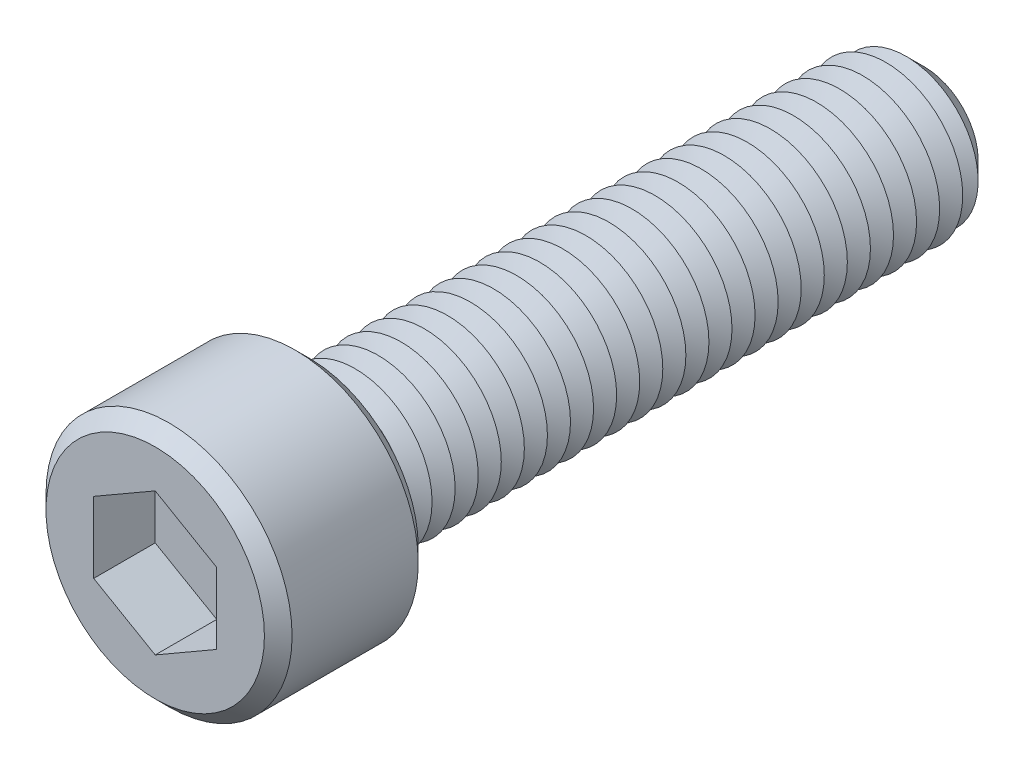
ISO-10303-21;
HEADER;
FILE_DESCRIPTION(('STEP AP214'),'2;1');
FILE_NAME('part.step','',(''),(''),'','','');
FILE_SCHEMA(('AUTOMOTIVE_DESIGN { 1 0 10303 214 1 1 1 1 }'));
ENDSEC;
DATA;
#1=APPLICATION_CONTEXT('core data for automotive mechanical design processes');
#2=APPLICATION_PROTOCOL_DEFINITION('international standard','automotive_design',2000,#1);
#3=PRODUCT_CONTEXT('',#1,'mechanical');
#4=PRODUCT('Part','Part','',(#3));
#5=PRODUCT_RELATED_PRODUCT_CATEGORY('part','',(#4));
#6=PRODUCT_DEFINITION_FORMATION('','',#4);
#7=PRODUCT_DEFINITION_CONTEXT('part definition',#1,'design');
#8=PRODUCT_DEFINITION('design','',#6,#7);
#9=PRODUCT_DEFINITION_SHAPE('','',#8);
#10=(LENGTH_UNIT() NAMED_UNIT(*) SI_UNIT(.MILLI.,.METRE.));
#11=(NAMED_UNIT(*) PLANE_ANGLE_UNIT() SI_UNIT($,.RADIAN.));
#12=(NAMED_UNIT(*) SI_UNIT($,.STERADIAN.) SOLID_ANGLE_UNIT());
#13=UNCERTAINTY_MEASURE_WITH_UNIT(LENGTH_MEASURE(1.E-05),#10,'distance_accuracy_value','');
#14=(GEOMETRIC_REPRESENTATION_CONTEXT(3) GLOBAL_UNCERTAINTY_ASSIGNED_CONTEXT((#13)) GLOBAL_UNIT_ASSIGNED_CONTEXT((#10,
#11,#12)) REPRESENTATION_CONTEXT('',''));
#15=CARTESIAN_POINT('',(0.,0.,0.));
#16=DIRECTION('',(0.,0.,1.));
#17=DIRECTION('',(1.,0.,0.));
#18=AXIS2_PLACEMENT_3D('',#15,#16,#17);
#19=CARTESIAN_POINT('',(0.,0.,10.));
#20=DIRECTION('',(0.,0.,-1.));
#21=DIRECTION('',(-1.,0.,0.));
#22=AXIS2_PLACEMENT_3D('',#19,#20,#21);
#23=CYLINDRICAL_SURFACE('',#22,8.);
#24=CARTESIAN_POINT('',(0.,0.,0.899999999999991));
#25=DIRECTION('',(0.,0.,1.));
#26=DIRECTION('',(1.,0.,0.));
#27=AXIS2_PLACEMENT_3D('',#24,#25,#26);
#28=CIRCLE('',#27,8.);
#29=CARTESIAN_POINT('',(8.,0.,0.899999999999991));
#30=VERTEX_POINT('',#29);
#31=EDGE_CURVE('E384',#30,#30,#28,.T.);
#32=ORIENTED_EDGE('',*,*,#31,.T.);
#33=EDGE_LOOP('',(#32));
#34=FACE_BOUND('',#33,.T.);
#35=CARTESIAN_POINT('',(0.,0.,9.1));
#36=DIRECTION('',(0.,0.,1.));
#37=DIRECTION('',(1.,0.,0.));
#38=AXIS2_PLACEMENT_3D('',#35,#36,#37);
#39=CIRCLE('',#38,8.);
#40=CARTESIAN_POINT('',(8.,0.,9.1));
#41=VERTEX_POINT('',#40);
#42=EDGE_CURVE('E377',#41,#41,#39,.F.);
#43=ORIENTED_EDGE('',*,*,#42,.T.);
#44=EDGE_LOOP('',(#43));
#45=FACE_BOUND('',#44,.T.);
#46=ADVANCED_FACE('F39',(#34,#45),#23,.T.);
#47=CARTESIAN_POINT('',(0.,0.,10.));
#48=DIRECTION('',(0.,0.,1.));
#49=DIRECTION('',(1.,0.,0.));
#50=AXIS2_PLACEMENT_3D('',#47,#48,#49);
#51=PLANE('',#50);
#52=CARTESIAN_POINT('',(0.,0.,10.));
#53=DIRECTION('',(0.,0.,1.));
#54=DIRECTION('',(1.,0.,0.));
#55=AXIS2_PLACEMENT_3D('',#52,#53,#54);
#56=CIRCLE('',#55,7.1);
#57=CARTESIAN_POINT('',(7.1,0.,10.));
#58=VERTEX_POINT('',#57);
#59=EDGE_CURVE('E11',#58,#58,#56,.T.);
#60=ORIENTED_EDGE('',*,*,#59,.T.);
#61=EDGE_LOOP('',(#60));
#62=FACE_BOUND('',#61,.T.);
#63=DIRECTION('',(-0.866025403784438,0.5,0.));
#64=VECTOR('',#63,1.);
#65=CARTESIAN_POINT('',(4.,2.3094010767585,10.));
#66=LINE('',#65,#64);
#67=CARTESIAN_POINT('',(4.,2.3094010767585,10.));
#68=VERTEX_POINT('',#67);
#69=CARTESIAN_POINT('',(0.,4.61880215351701,10.));
#70=VERTEX_POINT('',#69);
#71=EDGE_CURVE('E55',#68,#70,#66,.T.);
#72=ORIENTED_EDGE('',*,*,#71,.F.);
#73=DIRECTION('',(0.,1.,0.));
#74=VECTOR('',#73,1.);
#75=CARTESIAN_POINT('',(4.,-2.30940107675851,10.));
#76=LINE('',#75,#74);
#77=CARTESIAN_POINT('',(4.,-2.30940107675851,10.));
#78=VERTEX_POINT('',#77);
#79=EDGE_CURVE('E151',#78,#68,#76,.T.);
#80=ORIENTED_EDGE('',*,*,#79,.F.);
#81=DIRECTION('',(0.866025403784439,0.5,0.));
#82=VECTOR('',#81,1.);
#83=CARTESIAN_POINT('',(0.,-4.61880215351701,10.));
#84=LINE('',#83,#82);
#85=CARTESIAN_POINT('',(0.,-4.61880215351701,10.));
#86=VERTEX_POINT('',#85);
#87=EDGE_CURVE('E148',#86,#78,#84,.T.);
#88=ORIENTED_EDGE('',*,*,#87,.F.);
#89=DIRECTION('',(0.866025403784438,-0.5,0.));
#90=VECTOR('',#89,1.);
#91=CARTESIAN_POINT('',(-4.,-2.3094010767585,10.));
#92=LINE('',#91,#90);
#93=CARTESIAN_POINT('',(-4.,-2.3094010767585,10.));
#94=VERTEX_POINT('',#93);
#95=EDGE_CURVE('E103',#94,#86,#92,.T.);
#96=ORIENTED_EDGE('',*,*,#95,.F.);
#97=DIRECTION('',(0.,-1.,0.));
#98=VECTOR('',#97,1.);
#99=CARTESIAN_POINT('',(-4.,2.3094010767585,10.));
#100=LINE('',#99,#98);
#101=CARTESIAN_POINT('',(-4.,2.3094010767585,10.));
#102=VERTEX_POINT('',#101);
#103=EDGE_CURVE('E142',#102,#94,#100,.T.);
#104=ORIENTED_EDGE('',*,*,#103,.F.);
#105=DIRECTION('',(-0.866025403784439,-0.5,0.));
#106=VECTOR('',#105,1.);
#107=CARTESIAN_POINT('',(0.,4.61880215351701,10.));
#108=LINE('',#107,#106);
#109=EDGE_CURVE('E137',#70,#102,#108,.T.);
#110=ORIENTED_EDGE('',*,*,#109,.F.);
#111=EDGE_LOOP('',(#72,#80,#88,#96,#104,#110));
#112=FACE_BOUND('',#111,.T.);
#113=ADVANCED_FACE('F402',(#62,#112),#51,.T.);
#114=CARTESIAN_POINT('',(0.,0.,0.));
#115=DIRECTION('',(0.,0.,1.));
#116=DIRECTION('',(1.,0.,0.));
#117=AXIS2_PLACEMENT_3D('',#114,#115,#116);
#118=PLANE('',#117);
#119=CARTESIAN_POINT('',(0.,0.,0.));
#120=DIRECTION('',(0.,0.,1.));
#121=DIRECTION('',(1.,0.,0.));
#122=AXIS2_PLACEMENT_3D('',#119,#120,#121);
#123=CIRCLE('',#122,7.1);
#124=CARTESIAN_POINT('',(7.1,0.,0.));
#125=VERTEX_POINT('',#124);
#126=EDGE_CURVE('E48',#125,#125,#123,.F.);
#127=ORIENTED_EDGE('',*,*,#126,.T.);
#128=EDGE_LOOP('',(#127));
#129=FACE_BOUND('',#128,.T.);
#130=CARTESIAN_POINT('',(0.,0.,0.));
#131=DIRECTION('',(0.,0.,1.));
#132=DIRECTION('',(1.,0.,0.));
#133=AXIS2_PLACEMENT_3D('',#130,#131,#132);
#134=CIRCLE('',#133,5.);
#135=CARTESIAN_POINT('',(5.,0.,0.));
#136=VERTEX_POINT('',#135);
#137=EDGE_CURVE('E369',#136,#136,#134,.T.);
#138=ORIENTED_EDGE('',*,*,#137,.T.);
#139=EDGE_LOOP('',(#138));
#140=FACE_BOUND('',#139,.T.);
#141=ADVANCED_FACE('F391',(#129,#140),#118,.F.);
#142=CARTESIAN_POINT('',(0.,0.,0.));
#143=DIRECTION('',(0.,0.,1.));
#144=DIRECTION('',(1.,0.,0.));
#145=AXIS2_PLACEMENT_3D('',#142,#143,#144);
#146=CONICAL_SURFACE('',#145,5.,1.0471975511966);
#147=CARTESIAN_POINT('',(0.,0.,-0.75));
#148=DIRECTION('',(0.,0.,1.));
#149=DIRECTION('',(1.,0.,0.));
#150=AXIS2_PLACEMENT_3D('',#147,#148,#149);
#151=CIRCLE('',#150,3.70096189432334);
#152=CARTESIAN_POINT('',(3.70096189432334,0.,-0.75));
#153=VERTEX_POINT('',#152);
#154=EDGE_CURVE('E365',#153,#153,#151,.T.);
#155=ORIENTED_EDGE('',*,*,#154,.T.);
#156=EDGE_LOOP('',(#155));
#157=FACE_BOUND('',#156,.T.);
#158=ORIENTED_EDGE('',*,*,#137,.F.);
#159=EDGE_LOOP('',(#158));
#160=FACE_BOUND('',#159,.T.);
#161=ADVANCED_FACE('F660',(#157,#160),#146,.T.);
#162=CARTESIAN_POINT('',(0.,0.,-0.75));
#163=DIRECTION('',(0.,0.,-1.));
#164=DIRECTION('',(-1.,0.,0.));
#165=AXIS2_PLACEMENT_3D('',#162,#163,#164);
#166=CONICAL_SURFACE('',#165,3.70096189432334,1.0471975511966);
#167=CARTESIAN_POINT('',(0.,0.,-1.5));
#168=DIRECTION('',(0.,0.,1.));
#169=DIRECTION('',(1.,0.,0.));
#170=AXIS2_PLACEMENT_3D('',#167,#168,#169);
#171=CIRCLE('',#170,5.);
#172=CARTESIAN_POINT('',(5.,0.,-1.5));
#173=VERTEX_POINT('',#172);
#174=EDGE_CURVE('E361',#173,#173,#171,.T.);
#175=ORIENTED_EDGE('',*,*,#174,.T.);
#176=EDGE_LOOP('',(#175));
#177=FACE_BOUND('',#176,.T.);
#178=ORIENTED_EDGE('',*,*,#154,.F.);
#179=EDGE_LOOP('',(#178));
#180=FACE_BOUND('',#179,.T.);
#181=ADVANCED_FACE('F656',(#177,#180),#166,.T.);
#182=CARTESIAN_POINT('',(0.,0.,-1.5));
#183=DIRECTION('',(0.,0.,1.));
#184=DIRECTION('',(1.,0.,0.));
#185=AXIS2_PLACEMENT_3D('',#182,#183,#184);
#186=CONICAL_SURFACE('',#185,5.,1.0471975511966);
#187=CARTESIAN_POINT('',(0.,0.,-2.25));
#188=DIRECTION('',(0.,0.,1.));
#189=DIRECTION('',(1.,0.,0.));
#190=AXIS2_PLACEMENT_3D('',#187,#188,#189);
#191=CIRCLE('',#190,3.70096189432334);
#192=CARTESIAN_POINT('',(3.70096189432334,0.,-2.25));
#193=VERTEX_POINT('',#192);
#194=EDGE_CURVE('E357',#193,#193,#191,.T.);
#195=ORIENTED_EDGE('',*,*,#194,.T.);
#196=EDGE_LOOP('',(#195));
#197=FACE_BOUND('',#196,.T.);
#198=ORIENTED_EDGE('',*,*,#174,.F.);
#199=EDGE_LOOP('',(#198));
#200=FACE_BOUND('',#199,.T.);
#201=ADVANCED_FACE('F652',(#197,#200),#186,.T.);
#202=CARTESIAN_POINT('',(0.,0.,-2.25));
#203=DIRECTION('',(0.,0.,-1.));
#204=DIRECTION('',(-1.,0.,0.));
#205=AXIS2_PLACEMENT_3D('',#202,#203,#204);
#206=CONICAL_SURFACE('',#205,3.70096189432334,1.0471975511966);
#207=CARTESIAN_POINT('',(0.,0.,-3.));
#208=DIRECTION('',(0.,0.,1.));
#209=DIRECTION('',(1.,0.,0.));
#210=AXIS2_PLACEMENT_3D('',#207,#208,#209);
#211=CIRCLE('',#210,5.);
#212=CARTESIAN_POINT('',(5.,0.,-3.));
#213=VERTEX_POINT('',#212);
#214=EDGE_CURVE('E353',#213,#213,#211,.T.);
#215=ORIENTED_EDGE('',*,*,#214,.T.);
#216=EDGE_LOOP('',(#215));
#217=FACE_BOUND('',#216,.T.);
#218=ORIENTED_EDGE('',*,*,#194,.F.);
#219=EDGE_LOOP('',(#218));
#220=FACE_BOUND('',#219,.T.);
#221=ADVANCED_FACE('F648',(#217,#220),#206,.T.);
#222=CARTESIAN_POINT('',(0.,0.,-3.));
#223=DIRECTION('',(0.,0.,1.));
#224=DIRECTION('',(1.,0.,0.));
#225=AXIS2_PLACEMENT_3D('',#222,#223,#224);
#226=CONICAL_SURFACE('',#225,5.,1.0471975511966);
#227=CARTESIAN_POINT('',(0.,0.,-3.75));
#228=DIRECTION('',(0.,0.,1.));
#229=DIRECTION('',(1.,0.,0.));
#230=AXIS2_PLACEMENT_3D('',#227,#228,#229);
#231=CIRCLE('',#230,3.70096189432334);
#232=CARTESIAN_POINT('',(3.70096189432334,0.,-3.75));
#233=VERTEX_POINT('',#232);
#234=EDGE_CURVE('E349',#233,#233,#231,.T.);
#235=ORIENTED_EDGE('',*,*,#234,.T.);
#236=EDGE_LOOP('',(#235));
#237=FACE_BOUND('',#236,.T.);
#238=ORIENTED_EDGE('',*,*,#214,.F.);
#239=EDGE_LOOP('',(#238));
#240=FACE_BOUND('',#239,.T.);
#241=ADVANCED_FACE('F644',(#237,#240),#226,.T.);
#242=CARTESIAN_POINT('',(0.,0.,-3.75));
#243=DIRECTION('',(0.,0.,-1.));
#244=DIRECTION('',(-1.,0.,0.));
#245=AXIS2_PLACEMENT_3D('',#242,#243,#244);
#246=CONICAL_SURFACE('',#245,3.70096189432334,1.0471975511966);
#247=CARTESIAN_POINT('',(0.,0.,-4.5));
#248=DIRECTION('',(0.,0.,1.));
#249=DIRECTION('',(1.,0.,0.));
#250=AXIS2_PLACEMENT_3D('',#247,#248,#249);
#251=CIRCLE('',#250,5.);
#252=CARTESIAN_POINT('',(5.,0.,-4.5));
#253=VERTEX_POINT('',#252);
#254=EDGE_CURVE('E345',#253,#253,#251,.T.);
#255=ORIENTED_EDGE('',*,*,#254,.T.);
#256=EDGE_LOOP('',(#255));
#257=FACE_BOUND('',#256,.T.);
#258=ORIENTED_EDGE('',*,*,#234,.F.);
#259=EDGE_LOOP('',(#258));
#260=FACE_BOUND('',#259,.T.);
#261=ADVANCED_FACE('F640',(#257,#260),#246,.T.);
#262=CARTESIAN_POINT('',(0.,0.,-4.5));
#263=DIRECTION('',(0.,0.,1.));
#264=DIRECTION('',(1.,0.,0.));
#265=AXIS2_PLACEMENT_3D('',#262,#263,#264);
#266=CONICAL_SURFACE('',#265,5.,1.0471975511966);
#267=CARTESIAN_POINT('',(0.,0.,-5.25));
#268=DIRECTION('',(0.,0.,1.));
#269=DIRECTION('',(1.,0.,0.));
#270=AXIS2_PLACEMENT_3D('',#267,#268,#269);
#271=CIRCLE('',#270,3.70096189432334);
#272=CARTESIAN_POINT('',(3.70096189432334,0.,-5.25));
#273=VERTEX_POINT('',#272);
#274=EDGE_CURVE('E341',#273,#273,#271,.T.);
#275=ORIENTED_EDGE('',*,*,#274,.T.);
#276=EDGE_LOOP('',(#275));
#277=FACE_BOUND('',#276,.T.);
#278=ORIENTED_EDGE('',*,*,#254,.F.);
#279=EDGE_LOOP('',(#278));
#280=FACE_BOUND('',#279,.T.);
#281=ADVANCED_FACE('F636',(#277,#280),#266,.T.);
#282=CARTESIAN_POINT('',(0.,0.,-5.25));
#283=DIRECTION('',(0.,0.,-1.));
#284=DIRECTION('',(-1.,0.,0.));
#285=AXIS2_PLACEMENT_3D('',#282,#283,#284);
#286=CONICAL_SURFACE('',#285,3.70096189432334,1.0471975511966);
#287=CARTESIAN_POINT('',(0.,0.,-6.));
#288=DIRECTION('',(0.,0.,1.));
#289=DIRECTION('',(1.,0.,0.));
#290=AXIS2_PLACEMENT_3D('',#287,#288,#289);
#291=CIRCLE('',#290,5.);
#292=CARTESIAN_POINT('',(5.,0.,-6.));
#293=VERTEX_POINT('',#292);
#294=EDGE_CURVE('E337',#293,#293,#291,.T.);
#295=ORIENTED_EDGE('',*,*,#294,.T.);
#296=EDGE_LOOP('',(#295));
#297=FACE_BOUND('',#296,.T.);
#298=ORIENTED_EDGE('',*,*,#274,.F.);
#299=EDGE_LOOP('',(#298));
#300=FACE_BOUND('',#299,.T.);
#301=ADVANCED_FACE('F632',(#297,#300),#286,.T.);
#302=CARTESIAN_POINT('',(0.,0.,-6.));
#303=DIRECTION('',(0.,0.,1.));
#304=DIRECTION('',(1.,0.,0.));
#305=AXIS2_PLACEMENT_3D('',#302,#303,#304);
#306=CONICAL_SURFACE('',#305,5.,1.0471975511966);
#307=CARTESIAN_POINT('',(0.,0.,-6.75));
#308=DIRECTION('',(0.,0.,1.));
#309=DIRECTION('',(1.,0.,0.));
#310=AXIS2_PLACEMENT_3D('',#307,#308,#309);
#311=CIRCLE('',#310,3.70096189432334);
#312=CARTESIAN_POINT('',(3.70096189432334,0.,-6.75));
#313=VERTEX_POINT('',#312);
#314=EDGE_CURVE('E333',#313,#313,#311,.T.);
#315=ORIENTED_EDGE('',*,*,#314,.T.);
#316=EDGE_LOOP('',(#315));
#317=FACE_BOUND('',#316,.T.);
#318=ORIENTED_EDGE('',*,*,#294,.F.);
#319=EDGE_LOOP('',(#318));
#320=FACE_BOUND('',#319,.T.);
#321=ADVANCED_FACE('F628',(#317,#320),#306,.T.);
#322=CARTESIAN_POINT('',(0.,0.,-6.75));
#323=DIRECTION('',(0.,0.,-1.));
#324=DIRECTION('',(-1.,0.,0.));
#325=AXIS2_PLACEMENT_3D('',#322,#323,#324);
#326=CONICAL_SURFACE('',#325,3.70096189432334,1.0471975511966);
#327=CARTESIAN_POINT('',(0.,0.,-7.5));
#328=DIRECTION('',(0.,0.,1.));
#329=DIRECTION('',(1.,0.,0.));
#330=AXIS2_PLACEMENT_3D('',#327,#328,#329);
#331=CIRCLE('',#330,5.);
#332=CARTESIAN_POINT('',(5.,0.,-7.5));
#333=VERTEX_POINT('',#332);
#334=EDGE_CURVE('E329',#333,#333,#331,.T.);
#335=ORIENTED_EDGE('',*,*,#334,.T.);
#336=EDGE_LOOP('',(#335));
#337=FACE_BOUND('',#336,.T.);
#338=ORIENTED_EDGE('',*,*,#314,.F.);
#339=EDGE_LOOP('',(#338));
#340=FACE_BOUND('',#339,.T.);
#341=ADVANCED_FACE('F624',(#337,#340),#326,.T.);
#342=CARTESIAN_POINT('',(0.,0.,-7.5));
#343=DIRECTION('',(0.,0.,1.));
#344=DIRECTION('',(1.,0.,0.));
#345=AXIS2_PLACEMENT_3D('',#342,#343,#344);
#346=CONICAL_SURFACE('',#345,5.,1.0471975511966);
#347=CARTESIAN_POINT('',(0.,0.,-8.25));
#348=DIRECTION('',(0.,0.,1.));
#349=DIRECTION('',(1.,0.,0.));
#350=AXIS2_PLACEMENT_3D('',#347,#348,#349);
#351=CIRCLE('',#350,3.70096189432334);
#352=CARTESIAN_POINT('',(3.70096189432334,0.,-8.25));
#353=VERTEX_POINT('',#352);
#354=EDGE_CURVE('E325',#353,#353,#351,.T.);
#355=ORIENTED_EDGE('',*,*,#354,.T.);
#356=EDGE_LOOP('',(#355));
#357=FACE_BOUND('',#356,.T.);
#358=ORIENTED_EDGE('',*,*,#334,.F.);
#359=EDGE_LOOP('',(#358));
#360=FACE_BOUND('',#359,.T.);
#361=ADVANCED_FACE('F620',(#357,#360),#346,.T.);
#362=CARTESIAN_POINT('',(0.,0.,-8.25));
#363=DIRECTION('',(0.,0.,-1.));
#364=DIRECTION('',(-1.,0.,0.));
#365=AXIS2_PLACEMENT_3D('',#362,#363,#364);
#366=CONICAL_SURFACE('',#365,3.70096189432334,1.0471975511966);
#367=CARTESIAN_POINT('',(0.,0.,-9.));
#368=DIRECTION('',(0.,0.,1.));
#369=DIRECTION('',(1.,0.,0.));
#370=AXIS2_PLACEMENT_3D('',#367,#368,#369);
#371=CIRCLE('',#370,5.);
#372=CARTESIAN_POINT('',(5.,0.,-9.));
#373=VERTEX_POINT('',#372);
#374=EDGE_CURVE('E321',#373,#373,#371,.T.);
#375=ORIENTED_EDGE('',*,*,#374,.T.);
#376=EDGE_LOOP('',(#375));
#377=FACE_BOUND('',#376,.T.);
#378=ORIENTED_EDGE('',*,*,#354,.F.);
#379=EDGE_LOOP('',(#378));
#380=FACE_BOUND('',#379,.T.);
#381=ADVANCED_FACE('F616',(#377,#380),#366,.T.);
#382=CARTESIAN_POINT('',(0.,0.,-9.));
#383=DIRECTION('',(0.,0.,1.));
#384=DIRECTION('',(1.,0.,0.));
#385=AXIS2_PLACEMENT_3D('',#382,#383,#384);
#386=CONICAL_SURFACE('',#385,5.,1.0471975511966);
#387=CARTESIAN_POINT('',(0.,0.,-9.75));
#388=DIRECTION('',(0.,0.,1.));
#389=DIRECTION('',(1.,0.,0.));
#390=AXIS2_PLACEMENT_3D('',#387,#388,#389);
#391=CIRCLE('',#390,3.70096189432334);
#392=CARTESIAN_POINT('',(3.70096189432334,0.,-9.75));
#393=VERTEX_POINT('',#392);
#394=EDGE_CURVE('E317',#393,#393,#391,.T.);
#395=ORIENTED_EDGE('',*,*,#394,.T.);
#396=EDGE_LOOP('',(#395));
#397=FACE_BOUND('',#396,.T.);
#398=ORIENTED_EDGE('',*,*,#374,.F.);
#399=EDGE_LOOP('',(#398));
#400=FACE_BOUND('',#399,.T.);
#401=ADVANCED_FACE('F612',(#397,#400),#386,.T.);
#402=CARTESIAN_POINT('',(0.,0.,-9.75));
#403=DIRECTION('',(0.,0.,-1.));
#404=DIRECTION('',(-1.,0.,0.));
#405=AXIS2_PLACEMENT_3D('',#402,#403,#404);
#406=CONICAL_SURFACE('',#405,3.70096189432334,1.0471975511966);
#407=CARTESIAN_POINT('',(0.,0.,-10.5));
#408=DIRECTION('',(0.,0.,1.));
#409=DIRECTION('',(1.,0.,0.));
#410=AXIS2_PLACEMENT_3D('',#407,#408,#409);
#411=CIRCLE('',#410,5.);
#412=CARTESIAN_POINT('',(5.,0.,-10.5));
#413=VERTEX_POINT('',#412);
#414=EDGE_CURVE('E313',#413,#413,#411,.T.);
#415=ORIENTED_EDGE('',*,*,#414,.T.);
#416=EDGE_LOOP('',(#415));
#417=FACE_BOUND('',#416,.T.);
#418=ORIENTED_EDGE('',*,*,#394,.F.);
#419=EDGE_LOOP('',(#418));
#420=FACE_BOUND('',#419,.T.);
#421=ADVANCED_FACE('F608',(#417,#420),#406,.T.);
#422=CARTESIAN_POINT('',(0.,0.,-10.5));
#423=DIRECTION('',(0.,0.,1.));
#424=DIRECTION('',(1.,0.,0.));
#425=AXIS2_PLACEMENT_3D('',#422,#423,#424);
#426=CONICAL_SURFACE('',#425,5.,1.0471975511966);
#427=CARTESIAN_POINT('',(0.,0.,-11.25));
#428=DIRECTION('',(0.,0.,1.));
#429=DIRECTION('',(1.,0.,0.));
#430=AXIS2_PLACEMENT_3D('',#427,#428,#429);
#431=CIRCLE('',#430,3.70096189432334);
#432=CARTESIAN_POINT('',(3.70096189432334,0.,-11.25));
#433=VERTEX_POINT('',#432);
#434=EDGE_CURVE('E309',#433,#433,#431,.T.);
#435=ORIENTED_EDGE('',*,*,#434,.T.);
#436=EDGE_LOOP('',(#435));
#437=FACE_BOUND('',#436,.T.);
#438=ORIENTED_EDGE('',*,*,#414,.F.);
#439=EDGE_LOOP('',(#438));
#440=FACE_BOUND('',#439,.T.);
#441=ADVANCED_FACE('F604',(#437,#440),#426,.T.);
#442=CARTESIAN_POINT('',(0.,0.,-11.25));
#443=DIRECTION('',(0.,0.,-1.));
#444=DIRECTION('',(-1.,0.,0.));
#445=AXIS2_PLACEMENT_3D('',#442,#443,#444);
#446=CONICAL_SURFACE('',#445,3.70096189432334,1.0471975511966);
#447=CARTESIAN_POINT('',(0.,0.,-12.));
#448=DIRECTION('',(0.,0.,1.));
#449=DIRECTION('',(1.,0.,0.));
#450=AXIS2_PLACEMENT_3D('',#447,#448,#449);
#451=CIRCLE('',#450,5.);
#452=CARTESIAN_POINT('',(5.,0.,-12.));
#453=VERTEX_POINT('',#452);
#454=EDGE_CURVE('E305',#453,#453,#451,.T.);
#455=ORIENTED_EDGE('',*,*,#454,.T.);
#456=EDGE_LOOP('',(#455));
#457=FACE_BOUND('',#456,.T.);
#458=ORIENTED_EDGE('',*,*,#434,.F.);
#459=EDGE_LOOP('',(#458));
#460=FACE_BOUND('',#459,.T.);
#461=ADVANCED_FACE('F600',(#457,#460),#446,.T.);
#462=CARTESIAN_POINT('',(0.,0.,-12.));
#463=DIRECTION('',(0.,0.,1.));
#464=DIRECTION('',(1.,0.,0.));
#465=AXIS2_PLACEMENT_3D('',#462,#463,#464);
#466=CONICAL_SURFACE('',#465,5.,1.0471975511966);
#467=CARTESIAN_POINT('',(0.,0.,-12.75));
#468=DIRECTION('',(0.,0.,1.));
#469=DIRECTION('',(1.,0.,0.));
#470=AXIS2_PLACEMENT_3D('',#467,#468,#469);
#471=CIRCLE('',#470,3.70096189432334);
#472=CARTESIAN_POINT('',(3.70096189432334,0.,-12.75));
#473=VERTEX_POINT('',#472);
#474=EDGE_CURVE('E302',#473,#473,#471,.T.);
#475=ORIENTED_EDGE('',*,*,#474,.T.);
#476=EDGE_LOOP('',(#475));
#477=FACE_BOUND('',#476,.T.);
#478=ORIENTED_EDGE('',*,*,#454,.F.);
#479=EDGE_LOOP('',(#478));
#480=FACE_BOUND('',#479,.T.);
#481=ADVANCED_FACE('F596',(#477,#480),#466,.T.);
#482=CARTESIAN_POINT('',(0.,0.,-12.75));
#483=DIRECTION('',(0.,0.,-1.));
#484=DIRECTION('',(-1.,0.,0.));
#485=AXIS2_PLACEMENT_3D('',#482,#483,#484);
#486=CONICAL_SURFACE('',#485,3.70096189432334,1.0471975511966);
#487=CARTESIAN_POINT('',(0.,0.,-13.5));
#488=DIRECTION('',(0.,0.,1.));
#489=DIRECTION('',(1.,0.,0.));
#490=AXIS2_PLACEMENT_3D('',#487,#488,#489);
#491=CIRCLE('',#490,5.);
#492=CARTESIAN_POINT('',(5.,0.,-13.5));
#493=VERTEX_POINT('',#492);
#494=EDGE_CURVE('E298',#493,#493,#491,.T.);
#495=ORIENTED_EDGE('',*,*,#494,.T.);
#496=EDGE_LOOP('',(#495));
#497=FACE_BOUND('',#496,.T.);
#498=ORIENTED_EDGE('',*,*,#474,.F.);
#499=EDGE_LOOP('',(#498));
#500=FACE_BOUND('',#499,.T.);
#501=ADVANCED_FACE('F592',(#497,#500),#486,.T.);
#502=CARTESIAN_POINT('',(0.,0.,-13.5));
#503=DIRECTION('',(0.,0.,1.));
#504=DIRECTION('',(1.,0.,0.));
#505=AXIS2_PLACEMENT_3D('',#502,#503,#504);
#506=CONICAL_SURFACE('',#505,5.,1.0471975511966);
#507=CARTESIAN_POINT('',(0.,0.,-14.25));
#508=DIRECTION('',(0.,0.,1.));
#509=DIRECTION('',(1.,0.,0.));
#510=AXIS2_PLACEMENT_3D('',#507,#508,#509);
#511=CIRCLE('',#510,3.70096189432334);
#512=CARTESIAN_POINT('',(3.70096189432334,0.,-14.25));
#513=VERTEX_POINT('',#512);
#514=EDGE_CURVE('E294',#513,#513,#511,.T.);
#515=ORIENTED_EDGE('',*,*,#514,.T.);
#516=EDGE_LOOP('',(#515));
#517=FACE_BOUND('',#516,.T.);
#518=ORIENTED_EDGE('',*,*,#494,.F.);
#519=EDGE_LOOP('',(#518));
#520=FACE_BOUND('',#519,.T.);
#521=ADVANCED_FACE('F588',(#517,#520),#506,.T.);
#522=CARTESIAN_POINT('',(0.,0.,-14.25));
#523=DIRECTION('',(0.,0.,-1.));
#524=DIRECTION('',(-1.,0.,0.));
#525=AXIS2_PLACEMENT_3D('',#522,#523,#524);
#526=CONICAL_SURFACE('',#525,3.70096189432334,1.0471975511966);
#527=CARTESIAN_POINT('',(0.,0.,-15.));
#528=DIRECTION('',(0.,0.,1.));
#529=DIRECTION('',(1.,0.,0.));
#530=AXIS2_PLACEMENT_3D('',#527,#528,#529);
#531=CIRCLE('',#530,5.);
#532=CARTESIAN_POINT('',(5.,0.,-15.));
#533=VERTEX_POINT('',#532);
#534=EDGE_CURVE('E290',#533,#533,#531,.T.);
#535=ORIENTED_EDGE('',*,*,#534,.T.);
#536=EDGE_LOOP('',(#535));
#537=FACE_BOUND('',#536,.T.);
#538=ORIENTED_EDGE('',*,*,#514,.F.);
#539=EDGE_LOOP('',(#538));
#540=FACE_BOUND('',#539,.T.);
#541=ADVANCED_FACE('F584',(#537,#540),#526,.T.);
#542=CARTESIAN_POINT('',(0.,0.,-15.));
#543=DIRECTION('',(0.,0.,1.));
#544=DIRECTION('',(1.,0.,0.));
#545=AXIS2_PLACEMENT_3D('',#542,#543,#544);
#546=CONICAL_SURFACE('',#545,5.,1.0471975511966);
#547=CARTESIAN_POINT('',(0.,0.,-15.75));
#548=DIRECTION('',(0.,0.,1.));
#549=DIRECTION('',(1.,0.,0.));
#550=AXIS2_PLACEMENT_3D('',#547,#548,#549);
#551=CIRCLE('',#550,3.70096189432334);
#552=CARTESIAN_POINT('',(3.70096189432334,0.,-15.75));
#553=VERTEX_POINT('',#552);
#554=EDGE_CURVE('E286',#553,#553,#551,.T.);
#555=ORIENTED_EDGE('',*,*,#554,.T.);
#556=EDGE_LOOP('',(#555));
#557=FACE_BOUND('',#556,.T.);
#558=ORIENTED_EDGE('',*,*,#534,.F.);
#559=EDGE_LOOP('',(#558));
#560=FACE_BOUND('',#559,.T.);
#561=ADVANCED_FACE('F580',(#557,#560),#546,.T.);
#562=CARTESIAN_POINT('',(0.,0.,-15.75));
#563=DIRECTION('',(0.,0.,-1.));
#564=DIRECTION('',(-1.,0.,0.));
#565=AXIS2_PLACEMENT_3D('',#562,#563,#564);
#566=CONICAL_SURFACE('',#565,3.70096189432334,1.0471975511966);
#567=CARTESIAN_POINT('',(0.,0.,-16.5));
#568=DIRECTION('',(0.,0.,1.));
#569=DIRECTION('',(1.,0.,0.));
#570=AXIS2_PLACEMENT_3D('',#567,#568,#569);
#571=CIRCLE('',#570,5.);
#572=CARTESIAN_POINT('',(5.,0.,-16.5));
#573=VERTEX_POINT('',#572);
#574=EDGE_CURVE('E282',#573,#573,#571,.T.);
#575=ORIENTED_EDGE('',*,*,#574,.T.);
#576=EDGE_LOOP('',(#575));
#577=FACE_BOUND('',#576,.T.);
#578=ORIENTED_EDGE('',*,*,#554,.F.);
#579=EDGE_LOOP('',(#578));
#580=FACE_BOUND('',#579,.T.);
#581=ADVANCED_FACE('F576',(#577,#580),#566,.T.);
#582=CARTESIAN_POINT('',(0.,0.,-16.5));
#583=DIRECTION('',(0.,0.,1.));
#584=DIRECTION('',(1.,0.,0.));
#585=AXIS2_PLACEMENT_3D('',#582,#583,#584);
#586=CONICAL_SURFACE('',#585,5.,1.0471975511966);
#587=CARTESIAN_POINT('',(0.,0.,-17.25));
#588=DIRECTION('',(0.,0.,1.));
#589=DIRECTION('',(1.,0.,0.));
#590=AXIS2_PLACEMENT_3D('',#587,#588,#589);
#591=CIRCLE('',#590,3.70096189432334);
#592=CARTESIAN_POINT('',(3.70096189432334,0.,-17.25));
#593=VERTEX_POINT('',#592);
#594=EDGE_CURVE('E278',#593,#593,#591,.T.);
#595=ORIENTED_EDGE('',*,*,#594,.T.);
#596=EDGE_LOOP('',(#595));
#597=FACE_BOUND('',#596,.T.);
#598=ORIENTED_EDGE('',*,*,#574,.F.);
#599=EDGE_LOOP('',(#598));
#600=FACE_BOUND('',#599,.T.);
#601=ADVANCED_FACE('F572',(#597,#600),#586,.T.);
#602=CARTESIAN_POINT('',(0.,0.,-17.25));
#603=DIRECTION('',(0.,0.,-1.));
#604=DIRECTION('',(-1.,0.,0.));
#605=AXIS2_PLACEMENT_3D('',#602,#603,#604);
#606=CONICAL_SURFACE('',#605,3.70096189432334,1.0471975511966);
#607=CARTESIAN_POINT('',(0.,0.,-18.));
#608=DIRECTION('',(0.,0.,1.));
#609=DIRECTION('',(1.,0.,0.));
#610=AXIS2_PLACEMENT_3D('',#607,#608,#609);
#611=CIRCLE('',#610,5.);
#612=CARTESIAN_POINT('',(5.,0.,-18.));
#613=VERTEX_POINT('',#612);
#614=EDGE_CURVE('E274',#613,#613,#611,.T.);
#615=ORIENTED_EDGE('',*,*,#614,.T.);
#616=EDGE_LOOP('',(#615));
#617=FACE_BOUND('',#616,.T.);
#618=ORIENTED_EDGE('',*,*,#594,.F.);
#619=EDGE_LOOP('',(#618));
#620=FACE_BOUND('',#619,.T.);
#621=ADVANCED_FACE('F568',(#617,#620),#606,.T.);
#622=CARTESIAN_POINT('',(0.,0.,-18.));
#623=DIRECTION('',(0.,0.,1.));
#624=DIRECTION('',(1.,0.,0.));
#625=AXIS2_PLACEMENT_3D('',#622,#623,#624);
#626=CONICAL_SURFACE('',#625,5.,1.0471975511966);
#627=CARTESIAN_POINT('',(0.,0.,-18.75));
#628=DIRECTION('',(0.,0.,1.));
#629=DIRECTION('',(1.,0.,0.));
#630=AXIS2_PLACEMENT_3D('',#627,#628,#629);
#631=CIRCLE('',#630,3.70096189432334);
#632=CARTESIAN_POINT('',(3.70096189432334,0.,-18.75));
#633=VERTEX_POINT('',#632);
#634=EDGE_CURVE('E270',#633,#633,#631,.T.);
#635=ORIENTED_EDGE('',*,*,#634,.T.);
#636=EDGE_LOOP('',(#635));
#637=FACE_BOUND('',#636,.T.);
#638=ORIENTED_EDGE('',*,*,#614,.F.);
#639=EDGE_LOOP('',(#638));
#640=FACE_BOUND('',#639,.T.);
#641=ADVANCED_FACE('F564',(#637,#640),#626,.T.);
#642=CARTESIAN_POINT('',(0.,0.,-18.75));
#643=DIRECTION('',(0.,0.,-1.));
#644=DIRECTION('',(-1.,0.,0.));
#645=AXIS2_PLACEMENT_3D('',#642,#643,#644);
#646=CONICAL_SURFACE('',#645,3.70096189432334,1.0471975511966);
#647=CARTESIAN_POINT('',(0.,0.,-19.5));
#648=DIRECTION('',(0.,0.,1.));
#649=DIRECTION('',(1.,0.,0.));
#650=AXIS2_PLACEMENT_3D('',#647,#648,#649);
#651=CIRCLE('',#650,5.);
#652=CARTESIAN_POINT('',(5.,0.,-19.5));
#653=VERTEX_POINT('',#652);
#654=EDGE_CURVE('E266',#653,#653,#651,.T.);
#655=ORIENTED_EDGE('',*,*,#654,.T.);
#656=EDGE_LOOP('',(#655));
#657=FACE_BOUND('',#656,.T.);
#658=ORIENTED_EDGE('',*,*,#634,.F.);
#659=EDGE_LOOP('',(#658));
#660=FACE_BOUND('',#659,.T.);
#661=ADVANCED_FACE('F560',(#657,#660),#646,.T.);
#662=CARTESIAN_POINT('',(0.,0.,-19.5));
#663=DIRECTION('',(0.,0.,1.));
#664=DIRECTION('',(1.,0.,0.));
#665=AXIS2_PLACEMENT_3D('',#662,#663,#664);
#666=CONICAL_SURFACE('',#665,5.,1.0471975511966);
#667=CARTESIAN_POINT('',(0.,0.,-20.25));
#668=DIRECTION('',(0.,0.,1.));
#669=DIRECTION('',(1.,0.,0.));
#670=AXIS2_PLACEMENT_3D('',#667,#668,#669);
#671=CIRCLE('',#670,3.70096189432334);
#672=CARTESIAN_POINT('',(3.70096189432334,0.,-20.25));
#673=VERTEX_POINT('',#672);
#674=EDGE_CURVE('E263',#673,#673,#671,.T.);
#675=ORIENTED_EDGE('',*,*,#674,.T.);
#676=EDGE_LOOP('',(#675));
#677=FACE_BOUND('',#676,.T.);
#678=ORIENTED_EDGE('',*,*,#654,.F.);
#679=EDGE_LOOP('',(#678));
#680=FACE_BOUND('',#679,.T.);
#681=ADVANCED_FACE('F556',(#677,#680),#666,.T.);
#682=CARTESIAN_POINT('',(0.,0.,-20.25));
#683=DIRECTION('',(0.,0.,-1.));
#684=DIRECTION('',(-1.,0.,0.));
#685=AXIS2_PLACEMENT_3D('',#682,#683,#684);
#686=CONICAL_SURFACE('',#685,3.70096189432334,1.0471975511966);
#687=CARTESIAN_POINT('',(0.,0.,-21.));
#688=DIRECTION('',(0.,0.,1.));
#689=DIRECTION('',(1.,0.,0.));
#690=AXIS2_PLACEMENT_3D('',#687,#688,#689);
#691=CIRCLE('',#690,5.);
#692=CARTESIAN_POINT('',(5.,0.,-21.));
#693=VERTEX_POINT('',#692);
#694=EDGE_CURVE('E259',#693,#693,#691,.T.);
#695=ORIENTED_EDGE('',*,*,#694,.T.);
#696=EDGE_LOOP('',(#695));
#697=FACE_BOUND('',#696,.T.);
#698=ORIENTED_EDGE('',*,*,#674,.F.);
#699=EDGE_LOOP('',(#698));
#700=FACE_BOUND('',#699,.T.);
#701=ADVANCED_FACE('F552',(#697,#700),#686,.T.);
#702=CARTESIAN_POINT('',(0.,0.,-21.));
#703=DIRECTION('',(0.,0.,1.));
#704=DIRECTION('',(1.,0.,0.));
#705=AXIS2_PLACEMENT_3D('',#702,#703,#704);
#706=CONICAL_SURFACE('',#705,5.,1.0471975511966);
#707=CARTESIAN_POINT('',(0.,0.,-21.75));
#708=DIRECTION('',(0.,0.,1.));
#709=DIRECTION('',(1.,0.,0.));
#710=AXIS2_PLACEMENT_3D('',#707,#708,#709);
#711=CIRCLE('',#710,3.70096189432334);
#712=CARTESIAN_POINT('',(3.70096189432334,0.,-21.75));
#713=VERTEX_POINT('',#712);
#714=EDGE_CURVE('E255',#713,#713,#711,.T.);
#715=ORIENTED_EDGE('',*,*,#714,.T.);
#716=EDGE_LOOP('',(#715));
#717=FACE_BOUND('',#716,.T.);
#718=ORIENTED_EDGE('',*,*,#694,.F.);
#719=EDGE_LOOP('',(#718));
#720=FACE_BOUND('',#719,.T.);
#721=ADVANCED_FACE('F548',(#717,#720),#706,.T.);
#722=CARTESIAN_POINT('',(0.,0.,-21.75));
#723=DIRECTION('',(0.,0.,-1.));
#724=DIRECTION('',(-1.,0.,0.));
#725=AXIS2_PLACEMENT_3D('',#722,#723,#724);
#726=CONICAL_SURFACE('',#725,3.70096189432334,1.0471975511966);
#727=CARTESIAN_POINT('',(0.,0.,-22.5));
#728=DIRECTION('',(0.,0.,1.));
#729=DIRECTION('',(1.,0.,0.));
#730=AXIS2_PLACEMENT_3D('',#727,#728,#729);
#731=CIRCLE('',#730,5.);
#732=CARTESIAN_POINT('',(5.,0.,-22.5));
#733=VERTEX_POINT('',#732);
#734=EDGE_CURVE('E251',#733,#733,#731,.T.);
#735=ORIENTED_EDGE('',*,*,#734,.T.);
#736=EDGE_LOOP('',(#735));
#737=FACE_BOUND('',#736,.T.);
#738=ORIENTED_EDGE('',*,*,#714,.F.);
#739=EDGE_LOOP('',(#738));
#740=FACE_BOUND('',#739,.T.);
#741=ADVANCED_FACE('F544',(#737,#740),#726,.T.);
#742=CARTESIAN_POINT('',(0.,0.,-22.5));
#743=DIRECTION('',(0.,0.,1.));
#744=DIRECTION('',(1.,0.,0.));
#745=AXIS2_PLACEMENT_3D('',#742,#743,#744);
#746=CONICAL_SURFACE('',#745,5.,1.0471975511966);
#747=CARTESIAN_POINT('',(0.,0.,-23.25));
#748=DIRECTION('',(0.,0.,1.));
#749=DIRECTION('',(1.,0.,0.));
#750=AXIS2_PLACEMENT_3D('',#747,#748,#749);
#751=CIRCLE('',#750,3.70096189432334);
#752=CARTESIAN_POINT('',(3.70096189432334,0.,-23.25));
#753=VERTEX_POINT('',#752);
#754=EDGE_CURVE('E247',#753,#753,#751,.T.);
#755=ORIENTED_EDGE('',*,*,#754,.T.);
#756=EDGE_LOOP('',(#755));
#757=FACE_BOUND('',#756,.T.);
#758=ORIENTED_EDGE('',*,*,#734,.F.);
#759=EDGE_LOOP('',(#758));
#760=FACE_BOUND('',#759,.T.);
#761=ADVANCED_FACE('F540',(#757,#760),#746,.T.);
#762=CARTESIAN_POINT('',(0.,0.,-23.25));
#763=DIRECTION('',(0.,0.,-1.));
#764=DIRECTION('',(-1.,0.,0.));
#765=AXIS2_PLACEMENT_3D('',#762,#763,#764);
#766=CONICAL_SURFACE('',#765,3.70096189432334,1.0471975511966);
#767=CARTESIAN_POINT('',(0.,0.,-24.));
#768=DIRECTION('',(0.,0.,1.));
#769=DIRECTION('',(1.,0.,0.));
#770=AXIS2_PLACEMENT_3D('',#767,#768,#769);
#771=CIRCLE('',#770,5.);
#772=CARTESIAN_POINT('',(5.,0.,-24.));
#773=VERTEX_POINT('',#772);
#774=EDGE_CURVE('E243',#773,#773,#771,.T.);
#775=ORIENTED_EDGE('',*,*,#774,.T.);
#776=EDGE_LOOP('',(#775));
#777=FACE_BOUND('',#776,.T.);
#778=ORIENTED_EDGE('',*,*,#754,.F.);
#779=EDGE_LOOP('',(#778));
#780=FACE_BOUND('',#779,.T.);
#781=ADVANCED_FACE('F536',(#777,#780),#766,.T.);
#782=CARTESIAN_POINT('',(0.,0.,-24.));
#783=DIRECTION('',(0.,0.,1.));
#784=DIRECTION('',(1.,0.,0.));
#785=AXIS2_PLACEMENT_3D('',#782,#783,#784);
#786=CONICAL_SURFACE('',#785,5.,1.0471975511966);
#787=CARTESIAN_POINT('',(0.,0.,-24.75));
#788=DIRECTION('',(0.,0.,1.));
#789=DIRECTION('',(1.,0.,0.));
#790=AXIS2_PLACEMENT_3D('',#787,#788,#789);
#791=CIRCLE('',#790,3.70096189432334);
#792=CARTESIAN_POINT('',(3.70096189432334,0.,-24.75));
#793=VERTEX_POINT('',#792);
#794=EDGE_CURVE('E239',#793,#793,#791,.T.);
#795=ORIENTED_EDGE('',*,*,#794,.T.);
#796=EDGE_LOOP('',(#795));
#797=FACE_BOUND('',#796,.T.);
#798=ORIENTED_EDGE('',*,*,#774,.F.);
#799=EDGE_LOOP('',(#798));
#800=FACE_BOUND('',#799,.T.);
#801=ADVANCED_FACE('F532',(#797,#800),#786,.T.);
#802=CARTESIAN_POINT('',(0.,0.,-24.75));
#803=DIRECTION('',(0.,0.,-1.));
#804=DIRECTION('',(-1.,0.,0.));
#805=AXIS2_PLACEMENT_3D('',#802,#803,#804);
#806=CONICAL_SURFACE('',#805,3.70096189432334,1.0471975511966);
#807=CARTESIAN_POINT('',(0.,0.,-25.5));
#808=DIRECTION('',(0.,0.,1.));
#809=DIRECTION('',(1.,0.,0.));
#810=AXIS2_PLACEMENT_3D('',#807,#808,#809);
#811=CIRCLE('',#810,5.);
#812=CARTESIAN_POINT('',(5.,0.,-25.5));
#813=VERTEX_POINT('',#812);
#814=EDGE_CURVE('E235',#813,#813,#811,.T.);
#815=ORIENTED_EDGE('',*,*,#814,.T.);
#816=EDGE_LOOP('',(#815));
#817=FACE_BOUND('',#816,.T.);
#818=ORIENTED_EDGE('',*,*,#794,.F.);
#819=EDGE_LOOP('',(#818));
#820=FACE_BOUND('',#819,.T.);
#821=ADVANCED_FACE('F528',(#817,#820),#806,.T.);
#822=CARTESIAN_POINT('',(0.,0.,-25.5));
#823=DIRECTION('',(0.,0.,1.));
#824=DIRECTION('',(1.,0.,0.));
#825=AXIS2_PLACEMENT_3D('',#822,#823,#824);
#826=CONICAL_SURFACE('',#825,5.,1.0471975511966);
#827=CARTESIAN_POINT('',(0.,0.,-26.25));
#828=DIRECTION('',(0.,0.,1.));
#829=DIRECTION('',(1.,0.,0.));
#830=AXIS2_PLACEMENT_3D('',#827,#828,#829);
#831=CIRCLE('',#830,3.70096189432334);
#832=CARTESIAN_POINT('',(3.70096189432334,0.,-26.25));
#833=VERTEX_POINT('',#832);
#834=EDGE_CURVE('E231',#833,#833,#831,.T.);
#835=ORIENTED_EDGE('',*,*,#834,.T.);
#836=EDGE_LOOP('',(#835));
#837=FACE_BOUND('',#836,.T.);
#838=ORIENTED_EDGE('',*,*,#814,.F.);
#839=EDGE_LOOP('',(#838));
#840=FACE_BOUND('',#839,.T.);
#841=ADVANCED_FACE('F524',(#837,#840),#826,.T.);
#842=CARTESIAN_POINT('',(0.,0.,-26.25));
#843=DIRECTION('',(0.,0.,-1.));
#844=DIRECTION('',(-1.,0.,0.));
#845=AXIS2_PLACEMENT_3D('',#842,#843,#844);
#846=CONICAL_SURFACE('',#845,3.70096189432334,1.0471975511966);
#847=CARTESIAN_POINT('',(0.,0.,-27.));
#848=DIRECTION('',(0.,0.,1.));
#849=DIRECTION('',(1.,0.,0.));
#850=AXIS2_PLACEMENT_3D('',#847,#848,#849);
#851=CIRCLE('',#850,5.);
#852=CARTESIAN_POINT('',(5.,0.,-27.));
#853=VERTEX_POINT('',#852);
#854=EDGE_CURVE('E227',#853,#853,#851,.T.);
#855=ORIENTED_EDGE('',*,*,#854,.T.);
#856=EDGE_LOOP('',(#855));
#857=FACE_BOUND('',#856,.T.);
#858=ORIENTED_EDGE('',*,*,#834,.F.);
#859=EDGE_LOOP('',(#858));
#860=FACE_BOUND('',#859,.T.);
#861=ADVANCED_FACE('F520',(#857,#860),#846,.T.);
#862=CARTESIAN_POINT('',(0.,0.,-27.));
#863=DIRECTION('',(0.,0.,1.));
#864=DIRECTION('',(1.,0.,0.));
#865=AXIS2_PLACEMENT_3D('',#862,#863,#864);
#866=CONICAL_SURFACE('',#865,5.,1.0471975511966);
#867=CARTESIAN_POINT('',(0.,0.,-27.75));
#868=DIRECTION('',(0.,0.,1.));
#869=DIRECTION('',(1.,0.,0.));
#870=AXIS2_PLACEMENT_3D('',#867,#868,#869);
#871=CIRCLE('',#870,3.70096189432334);
#872=CARTESIAN_POINT('',(3.70096189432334,0.,-27.75));
#873=VERTEX_POINT('',#872);
#874=EDGE_CURVE('E223',#873,#873,#871,.T.);
#875=ORIENTED_EDGE('',*,*,#874,.T.);
#876=EDGE_LOOP('',(#875));
#877=FACE_BOUND('',#876,.T.);
#878=ORIENTED_EDGE('',*,*,#854,.F.);
#879=EDGE_LOOP('',(#878));
#880=FACE_BOUND('',#879,.T.);
#881=ADVANCED_FACE('F516',(#877,#880),#866,.T.);
#882=CARTESIAN_POINT('',(0.,0.,-27.75));
#883=DIRECTION('',(0.,0.,-1.));
#884=DIRECTION('',(-1.,0.,0.));
#885=AXIS2_PLACEMENT_3D('',#882,#883,#884);
#886=CONICAL_SURFACE('',#885,3.70096189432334,1.0471975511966);
#887=CARTESIAN_POINT('',(0.,0.,-28.5));
#888=DIRECTION('',(0.,0.,1.));
#889=DIRECTION('',(1.,0.,0.));
#890=AXIS2_PLACEMENT_3D('',#887,#888,#889);
#891=CIRCLE('',#890,5.);
#892=CARTESIAN_POINT('',(5.,0.,-28.5));
#893=VERTEX_POINT('',#892);
#894=EDGE_CURVE('E219',#893,#893,#891,.T.);
#895=ORIENTED_EDGE('',*,*,#894,.T.);
#896=EDGE_LOOP('',(#895));
#897=FACE_BOUND('',#896,.T.);
#898=ORIENTED_EDGE('',*,*,#874,.F.);
#899=EDGE_LOOP('',(#898));
#900=FACE_BOUND('',#899,.T.);
#901=ADVANCED_FACE('F512',(#897,#900),#886,.T.);
#902=CARTESIAN_POINT('',(0.,0.,-28.5));
#903=DIRECTION('',(0.,0.,1.));
#904=DIRECTION('',(1.,0.,0.));
#905=AXIS2_PLACEMENT_3D('',#902,#903,#904);
#906=CONICAL_SURFACE('',#905,5.,1.0471975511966);
#907=CARTESIAN_POINT('',(0.,0.,-29.25));
#908=DIRECTION('',(0.,0.,1.));
#909=DIRECTION('',(1.,0.,0.));
#910=AXIS2_PLACEMENT_3D('',#907,#908,#909);
#911=CIRCLE('',#910,3.70096189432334);
#912=CARTESIAN_POINT('',(3.70096189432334,0.,-29.25));
#913=VERTEX_POINT('',#912);
#914=EDGE_CURVE('E215',#913,#913,#911,.T.);
#915=ORIENTED_EDGE('',*,*,#914,.T.);
#916=EDGE_LOOP('',(#915));
#917=FACE_BOUND('',#916,.T.);
#918=ORIENTED_EDGE('',*,*,#894,.F.);
#919=EDGE_LOOP('',(#918));
#920=FACE_BOUND('',#919,.T.);
#921=ADVANCED_FACE('F508',(#917,#920),#906,.T.);
#922=CARTESIAN_POINT('',(0.,0.,-29.25));
#923=DIRECTION('',(0.,0.,-1.));
#924=DIRECTION('',(-1.,0.,0.));
#925=AXIS2_PLACEMENT_3D('',#922,#923,#924);
#926=CONICAL_SURFACE('',#925,3.70096189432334,1.0471975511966);
#927=CARTESIAN_POINT('',(0.,0.,-30.));
#928=DIRECTION('',(0.,0.,1.));
#929=DIRECTION('',(1.,0.,0.));
#930=AXIS2_PLACEMENT_3D('',#927,#928,#929);
#931=CIRCLE('',#930,5.);
#932=CARTESIAN_POINT('',(5.,0.,-30.));
#933=VERTEX_POINT('',#932);
#934=EDGE_CURVE('E211',#933,#933,#931,.T.);
#935=ORIENTED_EDGE('',*,*,#934,.T.);
#936=EDGE_LOOP('',(#935));
#937=FACE_BOUND('',#936,.T.);
#938=ORIENTED_EDGE('',*,*,#914,.F.);
#939=EDGE_LOOP('',(#938));
#940=FACE_BOUND('',#939,.T.);
#941=ADVANCED_FACE('F504',(#937,#940),#926,.T.);
#942=CARTESIAN_POINT('',(0.,0.,-30.));
#943=DIRECTION('',(0.,0.,1.));
#944=DIRECTION('',(1.,0.,0.));
#945=AXIS2_PLACEMENT_3D('',#942,#943,#944);
#946=CONICAL_SURFACE('',#945,5.,1.0471975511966);
#947=CARTESIAN_POINT('',(0.,0.,-30.75));
#948=DIRECTION('',(0.,0.,1.));
#949=DIRECTION('',(1.,0.,0.));
#950=AXIS2_PLACEMENT_3D('',#947,#948,#949);
#951=CIRCLE('',#950,3.70096189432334);
#952=CARTESIAN_POINT('',(3.70096189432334,0.,-30.75));
#953=VERTEX_POINT('',#952);
#954=EDGE_CURVE('E207',#953,#953,#951,.T.);
#955=ORIENTED_EDGE('',*,*,#954,.T.);
#956=EDGE_LOOP('',(#955));
#957=FACE_BOUND('',#956,.T.);
#958=ORIENTED_EDGE('',*,*,#934,.F.);
#959=EDGE_LOOP('',(#958));
#960=FACE_BOUND('',#959,.T.);
#961=ADVANCED_FACE('F500',(#957,#960),#946,.T.);
#962=CARTESIAN_POINT('',(0.,0.,-30.75));
#963=DIRECTION('',(0.,0.,-1.));
#964=DIRECTION('',(-1.,0.,0.));
#965=AXIS2_PLACEMENT_3D('',#962,#963,#964);
#966=CONICAL_SURFACE('',#965,3.70096189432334,1.0471975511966);
#967=CARTESIAN_POINT('',(0.,0.,-31.5));
#968=DIRECTION('',(0.,0.,1.));
#969=DIRECTION('',(1.,0.,0.));
#970=AXIS2_PLACEMENT_3D('',#967,#968,#969);
#971=CIRCLE('',#970,5.);
#972=CARTESIAN_POINT('',(5.,0.,-31.5));
#973=VERTEX_POINT('',#972);
#974=EDGE_CURVE('E203',#973,#973,#971,.T.);
#975=ORIENTED_EDGE('',*,*,#974,.T.);
#976=EDGE_LOOP('',(#975));
#977=FACE_BOUND('',#976,.T.);
#978=ORIENTED_EDGE('',*,*,#954,.F.);
#979=EDGE_LOOP('',(#978));
#980=FACE_BOUND('',#979,.T.);
#981=ADVANCED_FACE('F496',(#977,#980),#966,.T.);
#982=CARTESIAN_POINT('',(0.,0.,-31.5));
#983=DIRECTION('',(0.,0.,1.));
#984=DIRECTION('',(1.,0.,0.));
#985=AXIS2_PLACEMENT_3D('',#982,#983,#984);
#986=CONICAL_SURFACE('',#985,5.,1.0471975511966);
#987=CARTESIAN_POINT('',(0.,0.,-32.25));
#988=DIRECTION('',(0.,0.,1.));
#989=DIRECTION('',(1.,0.,0.));
#990=AXIS2_PLACEMENT_3D('',#987,#988,#989);
#991=CIRCLE('',#990,3.70096189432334);
#992=CARTESIAN_POINT('',(3.70096189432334,0.,-32.25));
#993=VERTEX_POINT('',#992);
#994=EDGE_CURVE('E199',#993,#993,#991,.T.);
#995=ORIENTED_EDGE('',*,*,#994,.T.);
#996=EDGE_LOOP('',(#995));
#997=FACE_BOUND('',#996,.T.);
#998=ORIENTED_EDGE('',*,*,#974,.F.);
#999=EDGE_LOOP('',(#998));
#1000=FACE_BOUND('',#999,.T.);
#1001=ADVANCED_FACE('F492',(#997,#1000),#986,.T.);
#1002=CARTESIAN_POINT('',(0.,0.,-32.25));
#1003=DIRECTION('',(0.,0.,-1.));
#1004=DIRECTION('',(-1.,0.,0.));
#1005=AXIS2_PLACEMENT_3D('',#1002,#1003,#1004);
#1006=CONICAL_SURFACE('',#1005,3.70096189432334,1.0471975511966);
#1007=CARTESIAN_POINT('',(0.,0.,-33.));
#1008=DIRECTION('',(0.,0.,1.));
#1009=DIRECTION('',(1.,0.,0.));
#1010=AXIS2_PLACEMENT_3D('',#1007,#1008,#1009);
#1011=CIRCLE('',#1010,5.);
#1012=CARTESIAN_POINT('',(5.,0.,-33.));
#1013=VERTEX_POINT('',#1012);
#1014=EDGE_CURVE('E195',#1013,#1013,#1011,.T.);
#1015=ORIENTED_EDGE('',*,*,#1014,.T.);
#1016=EDGE_LOOP('',(#1015));
#1017=FACE_BOUND('',#1016,.T.);
#1018=ORIENTED_EDGE('',*,*,#994,.F.);
#1019=EDGE_LOOP('',(#1018));
#1020=FACE_BOUND('',#1019,.T.);
#1021=ADVANCED_FACE('F488',(#1017,#1020),#1006,.T.);
#1022=CARTESIAN_POINT('',(0.,0.,-33.));
#1023=DIRECTION('',(0.,0.,1.));
#1024=DIRECTION('',(1.,0.,0.));
#1025=AXIS2_PLACEMENT_3D('',#1022,#1023,#1024);
#1026=CONICAL_SURFACE('',#1025,5.,1.0471975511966);
#1027=CARTESIAN_POINT('',(0.,0.,-33.75));
#1028=DIRECTION('',(0.,0.,1.));
#1029=DIRECTION('',(1.,0.,0.));
#1030=AXIS2_PLACEMENT_3D('',#1027,#1028,#1029);
#1031=CIRCLE('',#1030,3.70096189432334);
#1032=CARTESIAN_POINT('',(3.70096189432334,0.,-33.75));
#1033=VERTEX_POINT('',#1032);
#1034=EDGE_CURVE('E191',#1033,#1033,#1031,.T.);
#1035=ORIENTED_EDGE('',*,*,#1034,.T.);
#1036=EDGE_LOOP('',(#1035));
#1037=FACE_BOUND('',#1036,.T.);
#1038=ORIENTED_EDGE('',*,*,#1014,.F.);
#1039=EDGE_LOOP('',(#1038));
#1040=FACE_BOUND('',#1039,.T.);
#1041=ADVANCED_FACE('F484',(#1037,#1040),#1026,.T.);
#1042=CARTESIAN_POINT('',(0.,0.,-33.75));
#1043=DIRECTION('',(0.,0.,-1.));
#1044=DIRECTION('',(-1.,0.,0.));
#1045=AXIS2_PLACEMENT_3D('',#1042,#1043,#1044);
#1046=CONICAL_SURFACE('',#1045,3.70096189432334,1.0471975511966);
#1047=CARTESIAN_POINT('',(0.,0.,-34.5));
#1048=DIRECTION('',(0.,0.,1.));
#1049=DIRECTION('',(1.,0.,0.));
#1050=AXIS2_PLACEMENT_3D('',#1047,#1048,#1049);
#1051=CIRCLE('',#1050,5.);
#1052=CARTESIAN_POINT('',(5.,0.,-34.5));
#1053=VERTEX_POINT('',#1052);
#1054=EDGE_CURVE('E187',#1053,#1053,#1051,.T.);
#1055=ORIENTED_EDGE('',*,*,#1054,.T.);
#1056=EDGE_LOOP('',(#1055));
#1057=FACE_BOUND('',#1056,.T.);
#1058=ORIENTED_EDGE('',*,*,#1034,.F.);
#1059=EDGE_LOOP('',(#1058));
#1060=FACE_BOUND('',#1059,.T.);
#1061=ADVANCED_FACE('F480',(#1057,#1060),#1046,.T.);
#1062=CARTESIAN_POINT('',(0.,0.,-34.5));
#1063=DIRECTION('',(0.,0.,1.));
#1064=DIRECTION('',(1.,0.,0.));
#1065=AXIS2_PLACEMENT_3D('',#1062,#1063,#1064);
#1066=CONICAL_SURFACE('',#1065,5.,1.0471975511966);
#1067=CARTESIAN_POINT('',(0.,0.,-35.25));
#1068=DIRECTION('',(0.,0.,1.));
#1069=DIRECTION('',(1.,0.,0.));
#1070=AXIS2_PLACEMENT_3D('',#1067,#1068,#1069);
#1071=CIRCLE('',#1070,3.70096189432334);
#1072=CARTESIAN_POINT('',(3.70096189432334,0.,-35.25));
#1073=VERTEX_POINT('',#1072);
#1074=EDGE_CURVE('E183',#1073,#1073,#1071,.T.);
#1075=ORIENTED_EDGE('',*,*,#1074,.T.);
#1076=EDGE_LOOP('',(#1075));
#1077=FACE_BOUND('',#1076,.T.);
#1078=ORIENTED_EDGE('',*,*,#1054,.F.);
#1079=EDGE_LOOP('',(#1078));
#1080=FACE_BOUND('',#1079,.T.);
#1081=ADVANCED_FACE('F476',(#1077,#1080),#1066,.T.);
#1082=CARTESIAN_POINT('',(0.,0.,-35.25));
#1083=DIRECTION('',(0.,0.,-1.));
#1084=DIRECTION('',(-1.,0.,0.));
#1085=AXIS2_PLACEMENT_3D('',#1082,#1083,#1084);
#1086=CONICAL_SURFACE('',#1085,3.70096189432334,1.0471975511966);
#1087=CARTESIAN_POINT('',(0.,0.,-36.));
#1088=DIRECTION('',(0.,0.,1.));
#1089=DIRECTION('',(1.,0.,0.));
#1090=AXIS2_PLACEMENT_3D('',#1087,#1088,#1089);
#1091=CIRCLE('',#1090,5.);
#1092=CARTESIAN_POINT('',(5.,0.,-36.));
#1093=VERTEX_POINT('',#1092);
#1094=EDGE_CURVE('E179',#1093,#1093,#1091,.T.);
#1095=ORIENTED_EDGE('',*,*,#1094,.T.);
#1096=EDGE_LOOP('',(#1095));
#1097=FACE_BOUND('',#1096,.T.);
#1098=ORIENTED_EDGE('',*,*,#1074,.F.);
#1099=EDGE_LOOP('',(#1098));
#1100=FACE_BOUND('',#1099,.T.);
#1101=ADVANCED_FACE('F472',(#1097,#1100),#1086,.T.);
#1102=CARTESIAN_POINT('',(0.,0.,-36.));
#1103=DIRECTION('',(0.,0.,1.));
#1104=DIRECTION('',(1.,0.,0.));
#1105=AXIS2_PLACEMENT_3D('',#1102,#1103,#1104);
#1106=CONICAL_SURFACE('',#1105,5.,1.0471975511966);
#1107=CARTESIAN_POINT('',(0.,0.,-36.75));
#1108=DIRECTION('',(0.,0.,1.));
#1109=DIRECTION('',(1.,0.,0.));
#1110=AXIS2_PLACEMENT_3D('',#1107,#1108,#1109);
#1111=CIRCLE('',#1110,3.70096189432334);
#1112=CARTESIAN_POINT('',(3.70096189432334,0.,-36.75));
#1113=VERTEX_POINT('',#1112);
#1114=EDGE_CURVE('E175',#1113,#1113,#1111,.T.);
#1115=ORIENTED_EDGE('',*,*,#1114,.T.);
#1116=EDGE_LOOP('',(#1115));
#1117=FACE_BOUND('',#1116,.T.);
#1118=ORIENTED_EDGE('',*,*,#1094,.F.);
#1119=EDGE_LOOP('',(#1118));
#1120=FACE_BOUND('',#1119,.T.);
#1121=ADVANCED_FACE('F468',(#1117,#1120),#1106,.T.);
#1122=CARTESIAN_POINT('',(0.,0.,-36.75));
#1123=DIRECTION('',(0.,0.,-1.));
#1124=DIRECTION('',(-1.,0.,0.));
#1125=AXIS2_PLACEMENT_3D('',#1122,#1123,#1124);
#1126=CONICAL_SURFACE('',#1125,3.70096189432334,1.0471975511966);
#1127=CARTESIAN_POINT('',(0.,0.,-37.5));
#1128=DIRECTION('',(0.,0.,1.));
#1129=DIRECTION('',(1.,0.,0.));
#1130=AXIS2_PLACEMENT_3D('',#1127,#1128,#1129);
#1131=CIRCLE('',#1130,5.);
#1132=CARTESIAN_POINT('',(5.,0.,-37.5));
#1133=VERTEX_POINT('',#1132);
#1134=EDGE_CURVE('E170',#1133,#1133,#1131,.T.);
#1135=ORIENTED_EDGE('',*,*,#1134,.T.);
#1136=EDGE_LOOP('',(#1135));
#1137=FACE_BOUND('',#1136,.T.);
#1138=ORIENTED_EDGE('',*,*,#1114,.F.);
#1139=EDGE_LOOP('',(#1138));
#1140=FACE_BOUND('',#1139,.T.);
#1141=ADVANCED_FACE('F464',(#1137,#1140),#1126,.T.);
#1142=CARTESIAN_POINT('',(0.,0.,-37.5));
#1143=DIRECTION('',(0.,0.,1.));
#1144=DIRECTION('',(1.,0.,0.));
#1145=AXIS2_PLACEMENT_3D('',#1142,#1143,#1144);
#1146=CONICAL_SURFACE('',#1145,5.,1.0471975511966);
#1147=CARTESIAN_POINT('',(0.,0.,-38.25));
#1148=DIRECTION('',(0.,0.,1.));
#1149=DIRECTION('',(1.,0.,0.));
#1150=AXIS2_PLACEMENT_3D('',#1147,#1148,#1149);
#1151=CIRCLE('',#1150,3.70096189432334);
#1152=CARTESIAN_POINT('',(3.70096189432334,0.,-38.25));
#1153=VERTEX_POINT('',#1152);
#1154=EDGE_CURVE('E157',#1153,#1153,#1151,.T.);
#1155=ORIENTED_EDGE('',*,*,#1154,.T.);
#1156=EDGE_LOOP('',(#1155));
#1157=FACE_BOUND('',#1156,.T.);
#1158=ORIENTED_EDGE('',*,*,#1134,.F.);
#1159=EDGE_LOOP('',(#1158));
#1160=FACE_BOUND('',#1159,.T.);
#1161=ADVANCED_FACE('F460',(#1157,#1160),#1146,.T.);
#1162=CARTESIAN_POINT('',(0.,0.,-38.25));
#1163=DIRECTION('',(0.,0.,-1.));
#1164=DIRECTION('',(-1.,0.,0.));
#1165=AXIS2_PLACEMENT_3D('',#1162,#1163,#1164);
#1166=CONICAL_SURFACE('',#1165,3.70096189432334,1.0471975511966);
#1167=CARTESIAN_POINT('',(0.,0.,-38.8169872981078));
#1168=DIRECTION('',(0.,0.,-1.));
#1169=DIRECTION('',(-1.,0.,0.));
#1170=AXIS2_PLACEMENT_3D('',#1167,#1168,#1169);
#1171=CIRCLE('',#1170,4.68301270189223);
#1172=CARTESIAN_POINT('',(-4.68301270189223,0.,-38.8169872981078));
#1173=VERTEX_POINT('',#1172);
#1174=EDGE_CURVE('E174',#1173,#1173,#1171,.T.);
#1175=ORIENTED_EDGE('',*,*,#1174,.F.);
#1176=EDGE_LOOP('',(#1175));
#1177=FACE_BOUND('',#1176,.T.);
#1178=ORIENTED_EDGE('',*,*,#1154,.F.);
#1179=EDGE_LOOP('',(#1178));
#1180=FACE_BOUND('',#1179,.T.);
#1181=ADVANCED_FACE('F456',(#1177,#1180),#1166,.T.);
#1182=CARTESIAN_POINT('',(0.,0.,-40.));
#1183=DIRECTION('',(0.,0.,-1.));
#1184=DIRECTION('',(-1.,0.,0.));
#1185=AXIS2_PLACEMENT_3D('',#1182,#1183,#1184);
#1186=PLANE('',#1185);
#1187=CARTESIAN_POINT('',(0.,0.,-40.));
#1188=DIRECTION('',(0.,0.,-1.));
#1189=DIRECTION('',(-1.,0.,0.));
#1190=AXIS2_PLACEMENT_3D('',#1187,#1188,#1189);
#1191=CIRCLE('',#1190,0.9);
#1192=CARTESIAN_POINT('',(-0.9,0.,-40.));
#1193=VERTEX_POINT('',#1192);
#1194=EDGE_CURVE('E138',#1193,#1193,#1191,.F.);
#1195=ORIENTED_EDGE('',*,*,#1194,.T.);
#1196=EDGE_LOOP('',(#1195));
#1197=FACE_BOUND('',#1196,.T.);
#1198=CARTESIAN_POINT('',(0.,0.,-40.));
#1199=DIRECTION('',(0.,0.,-1.));
#1200=DIRECTION('',(-1.,0.,0.));
#1201=AXIS2_PLACEMENT_3D('',#1198,#1199,#1200);
#1202=CIRCLE('',#1201,3.50000000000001);
#1203=CARTESIAN_POINT('',(-3.50000000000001,0.,-40.));
#1204=VERTEX_POINT('',#1203);
#1205=EDGE_CURVE('E373',#1204,#1204,#1202,.T.);
#1206=ORIENTED_EDGE('',*,*,#1205,.T.);
#1207=EDGE_LOOP('',(#1206));
#1208=FACE_BOUND('',#1207,.T.);
#1209=ADVANCED_FACE('F459',(#1197,#1208),#1186,.T.);
#1210=CARTESIAN_POINT('',(0.,0.,-40.));
#1211=DIRECTION('',(0.,0.,1.));
#1212=DIRECTION('',(1.,0.,0.));
#1213=AXIS2_PLACEMENT_3D('',#1210,#1211,#1212);
#1214=CONICAL_SURFACE('',#1213,3.50000000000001,0.785398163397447);
#1215=ORIENTED_EDGE('',*,*,#1205,.F.);
#1216=EDGE_LOOP('',(#1215));
#1217=FACE_BOUND('',#1216,.T.);
#1218=ORIENTED_EDGE('',*,*,#1174,.T.);
#1219=EDGE_LOOP('',(#1218));
#1220=FACE_BOUND('',#1219,.T.);
#1221=ADVANCED_FACE('F455',(#1217,#1220),#1214,.T.);
#1222=CARTESIAN_POINT('',(4.,2.3094010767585,6.));
#1223=DIRECTION('',(0.5,0.866025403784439,0.));
#1224=DIRECTION('',(-0.866025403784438,0.5,0.));
#1225=AXIS2_PLACEMENT_3D('',#1222,#1223,#1224);
#1226=PLANE('',#1225);
#1227=ORIENTED_EDGE('',*,*,#71,.T.);
#1228=DIRECTION('',(0.,0.,1.));
#1229=VECTOR('',#1228,1.);
#1230=CARTESIAN_POINT('',(0.,4.61880215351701,6.));
#1231=LINE('',#1230,#1229);
#1232=CARTESIAN_POINT('',(0.,4.61880215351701,6.));
#1233=VERTEX_POINT('',#1232);
#1234=EDGE_CURVE('E85',#1233,#70,#1231,.T.);
#1235=ORIENTED_EDGE('',*,*,#1234,.F.);
#1236=DIRECTION('',(-0.866025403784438,0.5,0.));
#1237=VECTOR('',#1236,1.);
#1238=CARTESIAN_POINT('',(4.,2.3094010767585,6.));
#1239=LINE('',#1238,#1237);
#1240=CARTESIAN_POINT('',(4.,2.3094010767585,6.));
#1241=VERTEX_POINT('',#1240);
#1242=EDGE_CURVE('E154',#1241,#1233,#1239,.T.);
#1243=ORIENTED_EDGE('',*,*,#1242,.F.);
#1244=DIRECTION('',(0.,0.,1.));
#1245=VECTOR('',#1244,1.);
#1246=CARTESIAN_POINT('',(4.,2.3094010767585,6.));
#1247=LINE('',#1246,#1245);
#1248=EDGE_CURVE('E63',#1241,#68,#1247,.T.);
#1249=ORIENTED_EDGE('',*,*,#1248,.T.);
#1250=EDGE_LOOP('',(#1227,#1235,#1243,#1249));
#1251=FACE_BOUND('',#1250,.T.);
#1252=ADVANCED_FACE('F445',(#1251),#1226,.F.);
#1253=CARTESIAN_POINT('',(4.,-2.30940107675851,6.));
#1254=DIRECTION('',(1.,0.,0.));
#1255=DIRECTION('',(0.,0.,-1.));
#1256=AXIS2_PLACEMENT_3D('',#1253,#1254,#1255);
#1257=PLANE('',#1256);
#1258=ORIENTED_EDGE('',*,*,#79,.T.);
#1259=ORIENTED_EDGE('',*,*,#1248,.F.);
#1260=DIRECTION('',(0.,1.,0.));
#1261=VECTOR('',#1260,1.);
#1262=CARTESIAN_POINT('',(4.,-2.30940107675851,6.));
#1263=LINE('',#1262,#1261);
#1264=CARTESIAN_POINT('',(4.,-2.30940107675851,6.));
#1265=VERTEX_POINT('',#1264);
#1266=EDGE_CURVE('E117',#1265,#1241,#1263,.T.);
#1267=ORIENTED_EDGE('',*,*,#1266,.F.);
#1268=DIRECTION('',(0.,0.,1.));
#1269=VECTOR('',#1268,1.);
#1270=CARTESIAN_POINT('',(4.,-2.30940107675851,6.));
#1271=LINE('',#1270,#1269);
#1272=EDGE_CURVE('E108',#1265,#78,#1271,.T.);
#1273=ORIENTED_EDGE('',*,*,#1272,.T.);
#1274=EDGE_LOOP('',(#1258,#1259,#1267,#1273));
#1275=FACE_BOUND('',#1274,.T.);
#1276=ADVANCED_FACE('F442',(#1275),#1257,.F.);
#1277=CARTESIAN_POINT('',(0.,-4.61880215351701,6.));
#1278=DIRECTION('',(0.5,-0.866025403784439,0.));
#1279=DIRECTION('',(0.866025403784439,0.5,0.));
#1280=AXIS2_PLACEMENT_3D('',#1277,#1278,#1279);
#1281=PLANE('',#1280);
#1282=ORIENTED_EDGE('',*,*,#87,.T.);
#1283=ORIENTED_EDGE('',*,*,#1272,.F.);
#1284=DIRECTION('',(0.866025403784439,0.5,0.));
#1285=VECTOR('',#1284,1.);
#1286=CARTESIAN_POINT('',(0.,-4.61880215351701,6.));
#1287=LINE('',#1286,#1285);
#1288=CARTESIAN_POINT('',(0.,-4.61880215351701,6.));
#1289=VERTEX_POINT('',#1288);
#1290=EDGE_CURVE('E112',#1289,#1265,#1287,.T.);
#1291=ORIENTED_EDGE('',*,*,#1290,.F.);
#1292=DIRECTION('',(0.,0.,1.));
#1293=VECTOR('',#1292,1.);
#1294=CARTESIAN_POINT('',(0.,-4.61880215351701,6.));
#1295=LINE('',#1294,#1293);
#1296=EDGE_CURVE('E96',#1289,#86,#1295,.T.);
#1297=ORIENTED_EDGE('',*,*,#1296,.T.);
#1298=EDGE_LOOP('',(#1282,#1283,#1291,#1297));
#1299=FACE_BOUND('',#1298,.T.);
#1300=ADVANCED_FACE('F113',(#1299),#1281,.F.);
#1301=CARTESIAN_POINT('',(-4.,-2.3094010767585,6.));
#1302=DIRECTION('',(-0.5,-0.866025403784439,0.));
#1303=DIRECTION('',(0.866025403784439,-0.5,0.));
#1304=AXIS2_PLACEMENT_3D('',#1301,#1302,#1303);
#1305=PLANE('',#1304);
#1306=ORIENTED_EDGE('',*,*,#95,.T.);
#1307=ORIENTED_EDGE('',*,*,#1296,.F.);
#1308=DIRECTION('',(0.866025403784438,-0.5,0.));
#1309=VECTOR('',#1308,1.);
#1310=CARTESIAN_POINT('',(-4.,-2.3094010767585,6.));
#1311=LINE('',#1310,#1309);
#1312=CARTESIAN_POINT('',(-4.,-2.3094010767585,6.));
#1313=VERTEX_POINT('',#1312);
#1314=EDGE_CURVE('E100',#1313,#1289,#1311,.T.);
#1315=ORIENTED_EDGE('',*,*,#1314,.F.);
#1316=DIRECTION('',(0.,0.,1.));
#1317=VECTOR('',#1316,1.);
#1318=CARTESIAN_POINT('',(-4.,-2.3094010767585,6.));
#1319=LINE('',#1318,#1317);
#1320=EDGE_CURVE('E109',#1313,#94,#1319,.T.);
#1321=ORIENTED_EDGE('',*,*,#1320,.T.);
#1322=EDGE_LOOP('',(#1306,#1307,#1315,#1321));
#1323=FACE_BOUND('',#1322,.T.);
#1324=ADVANCED_FACE('F98',(#1323),#1305,.F.);
#1325=CARTESIAN_POINT('',(-4.,2.3094010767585,6.));
#1326=DIRECTION('',(-1.,0.,0.));
#1327=DIRECTION('',(0.,-1.,0.));
#1328=AXIS2_PLACEMENT_3D('',#1325,#1326,#1327);
#1329=PLANE('',#1328);
#1330=ORIENTED_EDGE('',*,*,#103,.T.);
#1331=ORIENTED_EDGE('',*,*,#1320,.F.);
#1332=DIRECTION('',(0.,-1.,0.));
#1333=VECTOR('',#1332,1.);
#1334=CARTESIAN_POINT('',(-4.,2.3094010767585,6.));
#1335=LINE('',#1334,#1333);
#1336=CARTESIAN_POINT('',(-4.,2.3094010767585,6.));
#1337=VERTEX_POINT('',#1336);
#1338=EDGE_CURVE('E123',#1337,#1313,#1335,.T.);
#1339=ORIENTED_EDGE('',*,*,#1338,.F.);
#1340=DIRECTION('',(0.,0.,1.));
#1341=VECTOR('',#1340,1.);
#1342=CARTESIAN_POINT('',(-4.,2.3094010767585,6.));
#1343=LINE('',#1342,#1341);
#1344=EDGE_CURVE('E162',#1337,#102,#1343,.T.);
#1345=ORIENTED_EDGE('',*,*,#1344,.T.);
#1346=EDGE_LOOP('',(#1330,#1331,#1339,#1345));
#1347=FACE_BOUND('',#1346,.T.);
#1348=ADVANCED_FACE('F439',(#1347),#1329,.F.);
#1349=CARTESIAN_POINT('',(0.,4.61880215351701,6.));
#1350=DIRECTION('',(-0.5,0.866025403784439,0.));
#1351=DIRECTION('',(-0.866025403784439,-0.5,0.));
#1352=AXIS2_PLACEMENT_3D('',#1349,#1350,#1351);
#1353=PLANE('',#1352);
#1354=ORIENTED_EDGE('',*,*,#109,.T.);
#1355=ORIENTED_EDGE('',*,*,#1344,.F.);
#1356=DIRECTION('',(-0.866025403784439,-0.5,0.));
#1357=VECTOR('',#1356,1.);
#1358=CARTESIAN_POINT('',(0.,4.61880215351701,6.));
#1359=LINE('',#1358,#1357);
#1360=EDGE_CURVE('E129',#1233,#1337,#1359,.T.);
#1361=ORIENTED_EDGE('',*,*,#1360,.F.);
#1362=ORIENTED_EDGE('',*,*,#1234,.T.);
#1363=EDGE_LOOP('',(#1354,#1355,#1361,#1362));
#1364=FACE_BOUND('',#1363,.T.);
#1365=ADVANCED_FACE('F417',(#1364),#1353,.F.);
#1366=CARTESIAN_POINT('',(0.,0.,6.));
#1367=DIRECTION('',(0.,0.,1.));
#1368=DIRECTION('',(1.,0.,0.));
#1369=AXIS2_PLACEMENT_3D('',#1366,#1367,#1368);
#1370=PLANE('',#1369);
#1371=CARTESIAN_POINT('',(0.,0.,6.));
#1372=DIRECTION('',(0.,0.,1.));
#1373=DIRECTION('',(1.,0.,0.));
#1374=AXIS2_PLACEMENT_3D('',#1371,#1372,#1373);
#1375=CIRCLE('',#1374,0.9);
#1376=CARTESIAN_POINT('',(0.9,0.,6.));
#1377=VERTEX_POINT('',#1376);
#1378=EDGE_CURVE('E425',#1377,#1377,#1375,.T.);
#1379=ORIENTED_EDGE('',*,*,#1378,.F.);
#1380=EDGE_LOOP('',(#1379));
#1381=FACE_BOUND('',#1380,.T.);
#1382=ORIENTED_EDGE('',*,*,#1242,.T.);
#1383=ORIENTED_EDGE('',*,*,#1360,.T.);
#1384=ORIENTED_EDGE('',*,*,#1338,.T.);
#1385=ORIENTED_EDGE('',*,*,#1314,.T.);
#1386=ORIENTED_EDGE('',*,*,#1290,.T.);
#1387=ORIENTED_EDGE('',*,*,#1266,.T.);
#1388=EDGE_LOOP('',(#1382,#1383,#1384,#1385,#1386,#1387));
#1389=FACE_BOUND('',#1388,.T.);
#1390=ADVANCED_FACE('F120',(#1381,#1389),#1370,.T.);
#1391=CARTESIAN_POINT('',(0.,0.,-42.5455844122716));
#1392=DIRECTION('',(0.,0.,1.));
#1393=DIRECTION('',(1.,0.,0.));
#1394=AXIS2_PLACEMENT_3D('',#1391,#1392,#1393);
#1395=CYLINDRICAL_SURFACE('',#1394,0.9);
#1396=ORIENTED_EDGE('',*,*,#1378,.T.);
#1397=EDGE_LOOP('',(#1396));
#1398=FACE_BOUND('',#1397,.T.);
#1399=ORIENTED_EDGE('',*,*,#1194,.F.);
#1400=EDGE_LOOP('',(#1399));
#1401=FACE_BOUND('',#1400,.T.);
#1402=ADVANCED_FACE('F397',(#1398,#1401),#1395,.F.);
#1403=CARTESIAN_POINT('',(0.,0.,0.899999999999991));
#1404=DIRECTION('',(0.,0.,1.));
#1405=DIRECTION('',(1.,0.,0.));
#1406=AXIS2_PLACEMENT_3D('',#1403,#1404,#1405);
#1407=CONICAL_SURFACE('',#1406,8.,0.785398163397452);
#1408=ORIENTED_EDGE('',*,*,#126,.F.);
#1409=EDGE_LOOP('',(#1408));
#1410=FACE_BOUND('',#1409,.T.);
#1411=ORIENTED_EDGE('',*,*,#31,.F.);
#1412=EDGE_LOOP('',(#1411));
#1413=FACE_BOUND('',#1412,.T.);
#1414=ADVANCED_FACE('F394',(#1410,#1413),#1407,.T.);
#1415=CARTESIAN_POINT('',(0.,0.,10.));
#1416=DIRECTION('',(0.,0.,-1.));
#1417=DIRECTION('',(-1.,0.,0.));
#1418=AXIS2_PLACEMENT_3D('',#1415,#1416,#1417);
#1419=CONICAL_SURFACE('',#1418,7.1,0.785398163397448);
#1420=ORIENTED_EDGE('',*,*,#42,.F.);
#1421=EDGE_LOOP('',(#1420));
#1422=FACE_BOUND('',#1421,.T.);
#1423=ORIENTED_EDGE('',*,*,#59,.F.);
#1424=EDGE_LOOP('',(#1423));
#1425=FACE_BOUND('',#1424,.T.);
#1426=ADVANCED_FACE('F41',(#1422,#1425),#1419,.T.);
#1427=CLOSED_SHELL('',(#46,#113,#141,#161,#181,#201,#221,#241,#261,#281,#301,#321,#341,#361,
#381,#401,#421,#441,#461,#481,#501,#521,#541,#561,#581,#601,#621,#641,#661,#681,#701,#721,#741,
#761,#781,#801,#821,#841,#861,#881,#901,#921,#941,#961,#981,#1001,#1021,#1041,#1061,#1081,#1101,
#1121,#1141,#1161,#1181,#1209,#1221,#1252,#1276,#1300,#1324,#1348,#1365,#1390,#1402,#1414,#1426));
#1428=MANIFOLD_SOLID_BREP('B2',#1427);
#1429=ADVANCED_BREP_SHAPE_REPRESENTATION('',(#18,#1428),#14);
#1430=SHAPE_DEFINITION_REPRESENTATION(#9,#1429);
ENDSEC;
END-ISO-10303-21;
